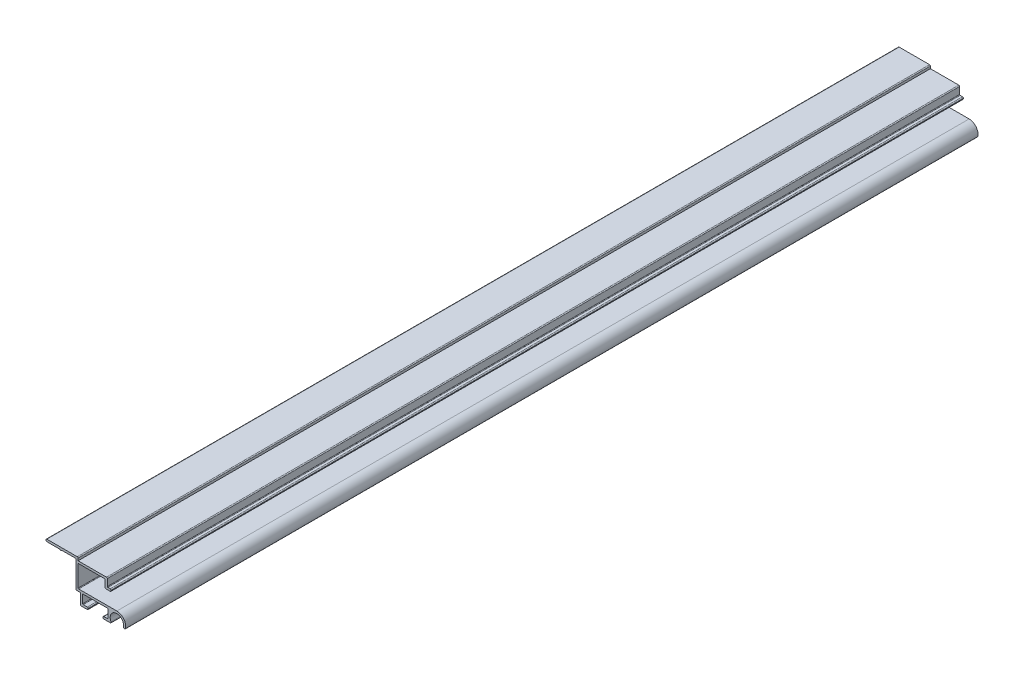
from build123d import *

# Parameters (mm, degrees)
BOSS_EXTRU_1_DEPTH = 385


with BuildPart() as part:
    # Esquisse1 → Boss.-Extru.1 (new body)
    with BuildSketch(Plane.XY):
        with BuildLine():
            Line((-7.19, 0), (-13.1, 0))
            ThreePointArc((-13.1, 0), (-13.382842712, 0.117157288), (-13.5, 0.4))
            Line((-13.5, 0.4), (-13.5, 0.6))
            ThreePointArc((-13.5, 0.6), (-13.382842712, 0.882842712), (-13.1, 1))
            Line((-13.1, 1), (0.6, 1))
            ThreePointArc((0.6, 1), (0.882842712, 0.882842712), (1, 0.6))
            Line((1, 0.6), (1, -0.4))
            Line((1, -0.4), (13.8, -0.4))
            ThreePointArc((13.8, -0.4), (14.082842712, -0.517157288), (14.2, -0.8))
            Line((14.2, -0.8), (14.2, -3.85))
            ThreePointArc((14.2, -3.85), (14.273223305, -4.026776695), (14.45, -4.1))
            Line((14.45, -4.1), (15.5, -4.1))
            ThreePointArc((15.5, -4.1), (15.782842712, -4.217157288), (15.9, -4.5))
            Line((15.9, -4.5), (15.9, -4.7))
            ThreePointArc((15.9, -4.7), (15.782842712, -4.982842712), (15.5, -5.1))
            Line((15.5, -5.1), (13.6, -5.1))
            ThreePointArc((13.6, -5.1), (13.317157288, -4.982842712), (13.2, -4.7))
            Line((13.2, -4.7), (13.2, -1.65))
            ThreePointArc((13.2, -1.65), (13.126776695, -1.473223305), (12.95, -1.4))
            Line((12.95, -1.4), (1.25, -1.4))
            ThreePointArc((1.25, -1.4), (1.073223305, -1.473223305), (1, -1.65))
            Line((1, -1.65), (1, -11.05))
            ThreePointArc((1, -11.05), (1.073223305, -11.226776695), (1.25, -11.3))
            Line((1.25, -11.3), (18.5, -11.3))
            ThreePointArc((18.5, -11.3), (21.643872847, -12.826932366), (22.387505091, -16.24196824))
            ThreePointArc((22.387505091, -16.24196824), (22.187711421, -16.50032682), (21.861946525, -16.523648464))
            Line((21.861946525, -16.523648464), (21.672939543, -16.454855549))
            ThreePointArc((21.672939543, -16.454855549), (21.457815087, -16.269092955), (21.420386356, -15.987338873))
            ThreePointArc((21.420386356, -15.987338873), (18.06291077, -12.331828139), (15.901719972, -16.800010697))
            ThreePointArc((15.901719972, -16.800010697), (15.901710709, -17.200005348), (15.555303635, -17.4))
            Line((15.555303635, -17.4), (12.657316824, -17.4))
            ThreePointArc((12.657316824, -17.4), (12.374474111, -17.282842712), (12.257316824, -17))
            Line((12.257316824, -17), (12.257316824, -16.8))
            ThreePointArc((12.257316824, -16.8), (12.374474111, -16.517157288), (12.657316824, -16.4))
            Line((12.657316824, -16.4), (14.25, -16.4))
            ThreePointArc((14.25, -16.4), (14.426776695, -16.326776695), (14.5, -16.15))
            Line((14.5, -16.15), (14.5, -12.55))
            ThreePointArc((14.5, -12.55), (14.426776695, -12.373223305), (14.25, -12.3))
            Line((14.25, -12.3), (3.307316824, -12.3))
            ThreePointArc((3.307316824, -12.3), (3.130540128, -12.373223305), (3.057316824, -12.55))
            Line((3.057316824, -12.55), (3.057316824, -16.15))
            ThreePointArc((3.057316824, -16.15), (3.130540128, -16.326776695), (3.307316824, -16.4))
            Line((3.307316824, -16.4), (5.157316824, -16.4))
            ThreePointArc((5.157316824, -16.4), (5.440159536, -16.517157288), (5.557316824, -16.8))
            Line((5.557316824, -16.8), (5.557316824, -17))
            ThreePointArc((5.557316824, -17), (5.440159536, -17.282842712), (5.157316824, -17.4))
            Line((5.157316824, -17.4), (2.457316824, -17.4))
            ThreePointArc((2.457316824, -17.4), (2.174474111, -17.282842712), (2.057316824, -17))
            Line((2.057316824, -17), (2.057316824, -12.55))
            ThreePointArc((2.057316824, -12.55), (1.984093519, -12.373223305), (1.807316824, -12.3))
            Line((1.807316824, -12.3), (1, -12.3))
            Line((1, -12.3), (0.4, -12.3))
            ThreePointArc((0.4, -12.3), (0.117157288, -12.182842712), (0, -11.9))
            Line((0, -11.9), (0, -8.040048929))
            Line((0, -8.040048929), (0, -7.092148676))
            Line((0, -7.092148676), (0, -0.25))
            ThreePointArc((0, -0.25), (-0.073223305, -0.073223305), (-0.25, 0))
            Line((-0.25, 0), (-6.31, 0))
            ThreePointArc((-6.31, 0), (-6.75, -0.22), (-7.19, 0))
        make_face()
    extrude(amount=BOSS_EXTRU_1_DEPTH)


solid = part.part
